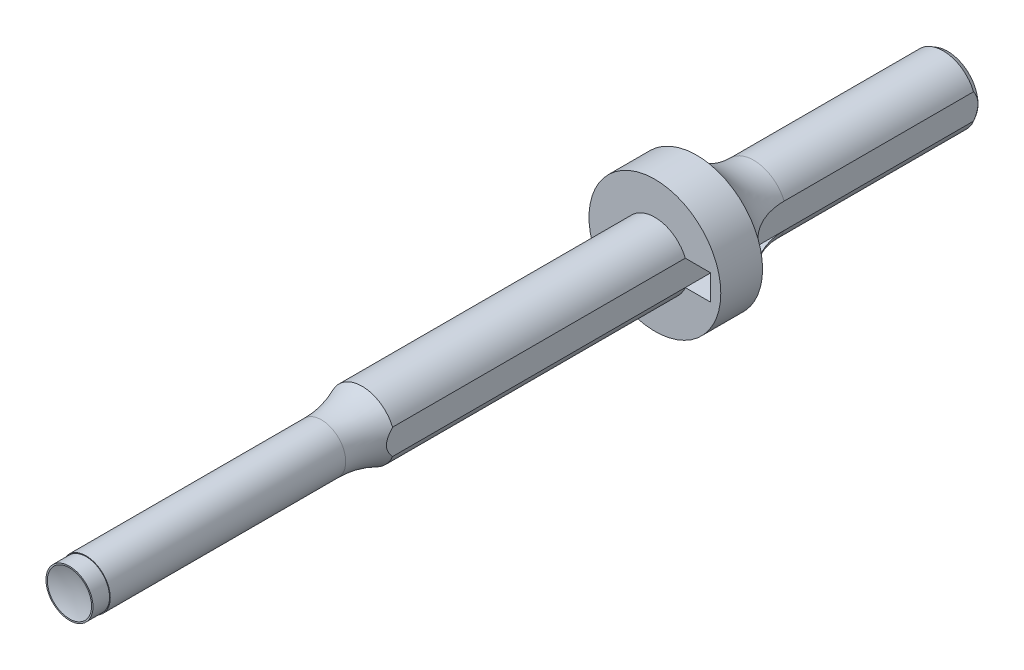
ISO-10303-21;
HEADER;
FILE_DESCRIPTION(('STEP AP214'),'2;1');
FILE_NAME('part.step','',(''),(''),'','','');
FILE_SCHEMA(('AUTOMOTIVE_DESIGN { 1 0 10303 214 1 1 1 1 }'));
ENDSEC;
DATA;
#1=APPLICATION_CONTEXT('core data for automotive mechanical design processes');
#2=APPLICATION_PROTOCOL_DEFINITION('international standard','automotive_design',2000,#1);
#3=PRODUCT_CONTEXT('',#1,'mechanical');
#4=PRODUCT('Part','Part','',(#3));
#5=PRODUCT_RELATED_PRODUCT_CATEGORY('part','',(#4));
#6=PRODUCT_DEFINITION_FORMATION('','',#4);
#7=PRODUCT_DEFINITION_CONTEXT('part definition',#1,'design');
#8=PRODUCT_DEFINITION('design','',#6,#7);
#9=PRODUCT_DEFINITION_SHAPE('','',#8);
#10=(LENGTH_UNIT() NAMED_UNIT(*) SI_UNIT(.MILLI.,.METRE.));
#11=(NAMED_UNIT(*) PLANE_ANGLE_UNIT() SI_UNIT($,.RADIAN.));
#12=(NAMED_UNIT(*) SI_UNIT($,.STERADIAN.) SOLID_ANGLE_UNIT());
#13=UNCERTAINTY_MEASURE_WITH_UNIT(LENGTH_MEASURE(1.E-05),#10,'distance_accuracy_value','');
#14=(GEOMETRIC_REPRESENTATION_CONTEXT(3) GLOBAL_UNCERTAINTY_ASSIGNED_CONTEXT((#13)) GLOBAL_UNIT_ASSIGNED_CONTEXT((#10,
#11,#12)) REPRESENTATION_CONTEXT('',''));
#15=CARTESIAN_POINT('',(0.,0.,0.));
#16=DIRECTION('',(0.,0.,1.));
#17=DIRECTION('',(1.,0.,0.));
#18=AXIS2_PLACEMENT_3D('',#15,#16,#17);
#19=CARTESIAN_POINT('',(0.,0.,-127.));
#20=DIRECTION('',(0.,0.,1.));
#21=DIRECTION('',(1.,0.,0.));
#22=AXIS2_PLACEMENT_3D('',#19,#20,#21);
#23=CYLINDRICAL_SURFACE('',#22,4.765);
#24=DIRECTION('',(0.,0.,-1.));
#25=VECTOR('',#24,1.);
#26=CARTESIAN_POINT('',(4.39549582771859,1.83979385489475,0.));
#27=LINE('',#26,#25);
#28=CARTESIAN_POINT('',(4.39549582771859,1.83979385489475,-42.333));
#29=VERTEX_POINT('',#28);
#30=CARTESIAN_POINT('',(4.39549582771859,1.83979385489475,-84.667));
#31=VERTEX_POINT('',#30);
#32=EDGE_CURVE('E198',#29,#31,#27,.T.);
#33=ORIENTED_EDGE('',*,*,#32,.T.);
#34=CARTESIAN_POINT('',(0.,0.,-84.667));
#35=DIRECTION('',(0.,0.,-1.));
#36=DIRECTION('',(-1.,0.,0.));
#37=AXIS2_PLACEMENT_3D('',#34,#35,#36);
#38=CIRCLE('',#37,4.765);
#39=CARTESIAN_POINT('',(4.39549582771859,-1.83979385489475,-84.667));
#40=VERTEX_POINT('',#39);
#41=EDGE_CURVE('E147',#31,#40,#38,.F.);
#42=ORIENTED_EDGE('',*,*,#41,.T.);
#43=DIRECTION('',(0.,0.,-1.));
#44=VECTOR('',#43,1.);
#45=CARTESIAN_POINT('',(4.39549582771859,-1.83979385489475,0.));
#46=LINE('',#45,#44);
#47=CARTESIAN_POINT('',(4.39549582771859,-1.83979385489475,-42.3330000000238));
#48=VERTEX_POINT('',#47);
#49=EDGE_CURVE('E63',#48,#40,#46,.T.);
#50=ORIENTED_EDGE('',*,*,#49,.F.);
#51=CARTESIAN_POINT('',(0.,0.,-42.333));
#52=DIRECTION('',(0.,0.,-1.));
#53=DIRECTION('',(0.,1.,0.));
#54=AXIS2_PLACEMENT_3D('',#51,#52,#53);
#55=CIRCLE('',#54,4.765);
#56=EDGE_CURVE('E148',#48,#29,#55,.T.);
#57=ORIENTED_EDGE('',*,*,#56,.T.);
#58=EDGE_LOOP('',(#33,#42,#50,#57));
#59=FACE_BOUND('',#58,.T.);
#60=ADVANCED_FACE('F40',(#59),#23,.T.);
#61=CARTESIAN_POINT('',(0.,0.,-42.333));
#62=DIRECTION('',(0.,0.,1.));
#63=DIRECTION('',(1.,0.,0.));
#64=AXIS2_PLACEMENT_3D('',#61,#62,#63);
#65=CYLINDRICAL_SURFACE('',#64,3.5);
#66=CARTESIAN_POINT('',(0.,0.,-36.4537036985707));
#67=DIRECTION('',(0.,0.,1.));
#68=DIRECTION('',(0.,-1.,0.));
#69=AXIS2_PLACEMENT_3D('',#66,#67,#68);
#70=CIRCLE('',#69,3.5);
#71=CARTESIAN_POINT('',(0.,-3.5,-36.4537036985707));
#72=VERTEX_POINT('',#71);
#73=EDGE_CURVE('E176',#72,#72,#70,.F.);
#74=ORIENTED_EDGE('',*,*,#73,.F.);
#75=EDGE_LOOP('',(#74));
#76=FACE_BOUND('',#75,.T.);
#77=CARTESIAN_POINT('',(0.,0.,-2.4));
#78=DIRECTION('',(0.,0.,1.));
#79=DIRECTION('',(1.,0.,0.));
#80=AXIS2_PLACEMENT_3D('',#77,#78,#79);
#81=CIRCLE('',#80,3.5);
#82=CARTESIAN_POINT('',(3.5,0.,-2.4));
#83=VERTEX_POINT('',#82);
#84=EDGE_CURVE('E161',#83,#83,#81,.F.);
#85=ORIENTED_EDGE('',*,*,#84,.T.);
#86=EDGE_LOOP('',(#85));
#87=FACE_BOUND('',#86,.T.);
#88=ADVANCED_FACE('F276',(#76,#87),#65,.T.);
#89=CARTESIAN_POINT('',(0.,0.,-2.4));
#90=DIRECTION('',(0.,0.,1.));
#91=DIRECTION('',(1.,0.,0.));
#92=AXIS2_PLACEMENT_3D('',#89,#90,#91);
#93=PLANE('',#92);
#94=ORIENTED_EDGE('',*,*,#84,.F.);
#95=EDGE_LOOP('',(#94));
#96=FACE_BOUND('',#95,.T.);
#97=CARTESIAN_POINT('',(0.,0.,-2.4));
#98=DIRECTION('',(0.,0.,1.));
#99=DIRECTION('',(1.,0.,0.));
#100=AXIS2_PLACEMENT_3D('',#97,#98,#99);
#101=CIRCLE('',#100,3.4);
#102=CARTESIAN_POINT('',(3.4,0.,-2.4));
#103=VERTEX_POINT('',#102);
#104=EDGE_CURVE('E157',#103,#103,#101,.T.);
#105=ORIENTED_EDGE('',*,*,#104,.F.);
#106=EDGE_LOOP('',(#105));
#107=FACE_BOUND('',#106,.T.);
#108=ADVANCED_FACE('F272',(#96,#107),#93,.T.);
#109=CARTESIAN_POINT('',(0.,0.,-2.4));
#110=DIRECTION('',(0.,0.,1.));
#111=DIRECTION('',(1.,0.,0.));
#112=AXIS2_PLACEMENT_3D('',#109,#110,#111);
#113=CYLINDRICAL_SURFACE('',#112,3.4);
#114=ORIENTED_EDGE('',*,*,#104,.T.);
#115=EDGE_LOOP('',(#114));
#116=FACE_BOUND('',#115,.T.);
#117=CARTESIAN_POINT('',(0.,0.,0.));
#118=DIRECTION('',(0.,0.,1.));
#119=DIRECTION('',(1.,0.,0.));
#120=AXIS2_PLACEMENT_3D('',#117,#118,#119);
#121=CIRCLE('',#120,3.4);
#122=CARTESIAN_POINT('',(3.4,0.,0.));
#123=VERTEX_POINT('',#122);
#124=EDGE_CURVE('E156',#123,#123,#121,.T.);
#125=ORIENTED_EDGE('',*,*,#124,.F.);
#126=EDGE_LOOP('',(#125));
#127=FACE_BOUND('',#126,.T.);
#128=ADVANCED_FACE('F269',(#116,#127),#113,.T.);
#129=CARTESIAN_POINT('',(0.,0.,0.));
#130=DIRECTION('',(0.,0.,1.));
#131=DIRECTION('',(1.,0.,0.));
#132=AXIS2_PLACEMENT_3D('',#129,#130,#131);
#133=PLANE('',#132);
#134=CARTESIAN_POINT('',(0.,0.,0.));
#135=DIRECTION('',(0.,0.,1.));
#136=DIRECTION('',(0.,-1.,0.));
#137=AXIS2_PLACEMENT_3D('',#134,#135,#136);
#138=CIRCLE('',#137,3.2);
#139=CARTESIAN_POINT('',(0.,-3.2,0.));
#140=VERTEX_POINT('',#139);
#141=EDGE_CURVE('E152',#140,#140,#138,.T.);
#142=ORIENTED_EDGE('',*,*,#141,.F.);
#143=EDGE_LOOP('',(#142));
#144=FACE_BOUND('',#143,.T.);
#145=ORIENTED_EDGE('',*,*,#124,.T.);
#146=EDGE_LOOP('',(#145));
#147=FACE_BOUND('',#146,.T.);
#148=ADVANCED_FACE('F267',(#144,#147),#133,.T.);
#149=CARTESIAN_POINT('',(0.,0.,8.97668647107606));
#150=DIRECTION('',(0.,0.,1.));
#151=DIRECTION('',(0.,1.,0.));
#152=AXIS2_PLACEMENT_3D('',#149,#150,#151);
#153=SPHERICAL_SURFACE('',#152,9.53);
#154=ORIENTED_EDGE('',*,*,#141,.T.);
#155=EDGE_LOOP('',(#154));
#156=FACE_BOUND('',#155,.T.);
#157=ADVANCED_FACE('F263',(#156),#153,.F.);
#158=CARTESIAN_POINT('',(0.,0.,-36.4537036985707));
#159=DIRECTION('',(0.,0.,-1.));
#160=DIRECTION('',(0.,1.,0.));
#161=AXIS2_PLACEMENT_3D('',#158,#159,#160);
#162=TOROIDAL_SURFACE('',#161,17.795,14.295);
#163=CARTESIAN_POINT('',(4.39549582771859,8.77580604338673,-48.3140317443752));
#164=CARTESIAN_POINT('',(4.39549582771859,8.57569992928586,-48.1936621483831));
#165=CARTESIAN_POINT('',(4.39549582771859,8.37784880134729,-48.0695715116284));
#166=CARTESIAN_POINT('',(4.39549582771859,7.98672980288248,-47.8144323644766));
#167=CARTESIAN_POINT('',(4.39549582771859,7.79346116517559,-47.6833850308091));
#168=CARTESIAN_POINT('',(4.39549582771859,7.41185102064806,-47.4150135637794));
#169=CARTESIAN_POINT('',(4.39549582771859,7.22350139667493,-47.277700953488));
#170=CARTESIAN_POINT('',(4.39549582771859,6.85132024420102,-46.9970757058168));
#171=CARTESIAN_POINT('',(4.39549582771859,6.66748889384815,-46.8537628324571));
#172=CARTESIAN_POINT('',(4.39549582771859,6.30611541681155,-46.5631911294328));
#173=CARTESIAN_POINT('',(4.39549582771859,6.12852777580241,-46.415988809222));
#174=CARTESIAN_POINT('',(4.39549582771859,5.77744023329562,-46.116785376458));
#175=CARTESIAN_POINT('',(4.39549582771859,5.60394045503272,-45.9647841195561));
#176=CARTESIAN_POINT('',(4.39549582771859,5.26064882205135,-45.6565520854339));
#177=CARTESIAN_POINT('',(4.39549582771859,5.09085815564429,-45.5003199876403));
#178=CARTESIAN_POINT('',(4.39549582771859,4.75456331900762,-45.1843666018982));
#179=CARTESIAN_POINT('',(4.39549582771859,4.58805915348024,-45.0246453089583));
#180=CARTESIAN_POINT('',(4.39549582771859,4.2595478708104,-44.7043667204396));
#181=CARTESIAN_POINT('',(4.39549582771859,4.09751112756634,-44.5438397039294));
#182=CARTESIAN_POINT('',(4.39549582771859,3.77509953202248,-44.2211645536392));
#183=CARTESIAN_POINT('',(4.39549582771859,3.61472451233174,-44.0590165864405));
#184=CARTESIAN_POINT('',(4.39549582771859,3.29415714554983,-43.7342079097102));
#185=CARTESIAN_POINT('',(4.39549582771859,3.13396516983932,-43.5715468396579));
#186=CARTESIAN_POINT('',(4.39549582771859,2.81206790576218,-43.2477295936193));
#187=CARTESIAN_POINT('',(4.39549582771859,2.6503627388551,-43.0865732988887));
#188=CARTESIAN_POINT('',(4.39549582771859,2.40188400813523,-42.8457541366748));
#189=CARTESIAN_POINT('',(4.39549582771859,2.31674209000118,-42.7644168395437));
#190=CARTESIAN_POINT('',(4.39549582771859,2.14470021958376,-42.6036291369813));
#191=CARTESIAN_POINT('',(4.39549582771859,2.05780042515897,-42.5241785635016));
#192=CARTESIAN_POINT('',(4.39549582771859,1.88149605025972,-42.3680300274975));
#193=CARTESIAN_POINT('',(4.39549582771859,1.79209074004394,-42.2913328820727));
#194=CARTESIAN_POINT('',(4.39549582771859,1.60990647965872,-42.142082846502));
#195=CARTESIAN_POINT('',(4.39549582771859,1.51712869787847,-42.0695285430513));
#196=CARTESIAN_POINT('',(4.39549582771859,1.30605820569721,-41.9151566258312));
#197=CARTESIAN_POINT('',(4.39549582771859,1.18665362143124,-41.8348289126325));
#198=CARTESIAN_POINT('',(4.39549582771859,0.938862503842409,-41.6892579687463));
#199=CARTESIAN_POINT('',(4.39549582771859,0.810495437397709,-41.6239832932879));
#200=CARTESIAN_POINT('',(4.39549582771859,0.583257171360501,-41.5337799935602));
#201=CARTESIAN_POINT('',(4.39549582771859,0.486928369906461,-41.5026271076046));
#202=CARTESIAN_POINT('',(4.39549582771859,0.290482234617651,-41.4565899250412));
#203=CARTESIAN_POINT('',(4.39549582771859,0.190372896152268,-41.4416730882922));
#204=CARTESIAN_POINT('',(4.39549582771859,-0.01156243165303,-41.4306079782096));
#205=CARTESIAN_POINT('',(4.39549582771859,-0.113395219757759,-41.4345767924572));
#206=CARTESIAN_POINT('',(4.39549582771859,-0.314609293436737,-41.4607860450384));
#207=CARTESIAN_POINT('',(4.39549582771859,-0.413988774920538,-41.4830395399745));
#208=CARTESIAN_POINT('',(4.39549582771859,-0.647645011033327,-41.5543208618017));
#209=CARTESIAN_POINT('',(4.39549582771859,-0.779663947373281,-41.6105593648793));
#210=CARTESIAN_POINT('',(4.39549582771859,-0.97044483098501,-41.7087535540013));
#211=CARTESIAN_POINT('',(4.39549582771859,-1.03300896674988,-41.7439187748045));
#212=CARTESIAN_POINT('',(4.39549582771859,-1.15594016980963,-41.8178893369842));
#213=CARTESIAN_POINT('',(4.39549582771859,-1.21630806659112,-41.8566932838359));
#214=CARTESIAN_POINT('',(4.39549582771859,-1.39388060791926,-41.9768603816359));
#215=CARTESIAN_POINT('',(4.39549582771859,-1.50825762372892,-42.0623639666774));
#216=CARTESIAN_POINT('',(4.39549582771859,-1.73165888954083,-42.2401506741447));
#217=CARTESIAN_POINT('',(4.39549582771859,-1.84067772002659,-42.3324404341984));
#218=CARTESIAN_POINT('',(4.39549582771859,-2.05528531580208,-42.5214916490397));
#219=CARTESIAN_POINT('',(4.39549582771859,-2.16086349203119,-42.6182650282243));
#220=CARTESIAN_POINT('',(4.39549582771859,-2.36955953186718,-42.8144344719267));
#221=CARTESIAN_POINT('',(4.39549582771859,-2.47267704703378,-42.9138309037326));
#222=CARTESIAN_POINT('',(4.39549582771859,-2.67811046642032,-43.1148716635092));
#223=CARTESIAN_POINT('',(4.39549582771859,-2.78041567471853,-43.2165268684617));
#224=CARTESIAN_POINT('',(4.39549582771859,-2.98421749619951,-43.4206581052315));
#225=CARTESIAN_POINT('',(4.39549582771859,-3.08571404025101,-43.5231342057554));
#226=CARTESIAN_POINT('',(4.39549582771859,-3.38950767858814,-43.8305743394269));
#227=CARTESIAN_POINT('',(4.39549582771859,-3.59144795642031,-44.0358902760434));
#228=CARTESIAN_POINT('',(4.39549582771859,-3.98351711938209,-44.4303774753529));
#229=CARTESIAN_POINT('',(4.39549582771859,-4.17350421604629,-44.619688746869));
#230=CARTESIAN_POINT('',(4.39549582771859,-4.55688891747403,-44.9948391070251));
#231=CARTESIAN_POINT('',(4.39549582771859,-4.7502864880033,-45.1806782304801));
#232=CARTESIAN_POINT('',(4.39549582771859,-5.14157018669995,-45.5475929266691));
#233=CARTESIAN_POINT('',(4.39549582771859,-5.33945638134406,-45.7286684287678));
#234=CARTESIAN_POINT('',(4.39549582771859,-5.74041934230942,-46.0849741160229));
#235=CARTESIAN_POINT('',(4.39549582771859,-5.9434958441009,-46.2602045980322));
#236=CARTESIAN_POINT('',(4.39549582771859,-6.3560542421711,-46.6045116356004));
#237=CARTESIAN_POINT('',(4.39549582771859,-6.56555654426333,-46.7735637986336));
#238=CARTESIAN_POINT('',(4.39549582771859,-6.99052349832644,-47.1039852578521));
#239=CARTESIAN_POINT('',(4.39549582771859,-7.20598776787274,-47.2653550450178));
#240=CARTESIAN_POINT('',(4.39549582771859,-7.64358598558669,-47.5800501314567));
#241=CARTESIAN_POINT('',(4.39549582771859,-7.86573596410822,-47.7333531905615));
#242=CARTESIAN_POINT('',(4.39549582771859,-8.31618358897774,-48.030775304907));
#243=CARTESIAN_POINT('',(4.39549582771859,-8.54448289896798,-48.1748918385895));
#244=CARTESIAN_POINT('',(4.39549582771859,-8.77580604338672,-48.3140317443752));
#245=B_SPLINE_CURVE_WITH_KNOTS('',3,(#163,#164,#165,#166,#167,#168,#169,#170,#171,#172,#173,
#174,#175,#176,#177,#178,#179,#180,#181,#182,#183,#184,#185,#186,#187,#188,#189,#190,#191,#192,
#193,#194,#195,#196,#197,#198,#199,#200,#201,#202,#203,#204,#205,#206,#207,#208,#209,#210,#211,
#212,#213,#214,#215,#216,#217,#218,#219,#220,#221,#222,#223,#224,#225,#226,#227,#228,#229,#230,
#231,#232,#233,#234,#235,#236,#237,#238,#239,#240,#241,#242,#243,#244),.UNSPECIFIED.,.F.,.F.,(4,
2,2,2,2,2,2,2,2,2,2,2,2,2,2,2,2,2,2,2,2,2,2,2,2,2,2,2,2,2,2,2,2,2,2,2,2,2,2,2,4),(0.,
0.700496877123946,1.40087563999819,2.10001446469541,2.79918081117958,3.49107877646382,
4.18299757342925,4.8751348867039,5.56727319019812,6.2515224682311,6.93570213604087,
7.6206038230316,8.30545099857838,8.65867999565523,9.01187741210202,9.36517879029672,
9.7183589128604,10.149490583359,10.5797133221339,10.8823484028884,11.1843758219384,
11.4882781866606,11.7923977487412,12.2202866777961,12.4355393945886,12.6507099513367,
13.0786568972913,13.5070281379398,13.9366126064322,14.3662575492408,14.7989161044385,
15.2316112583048,16.0955606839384,16.9001494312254,17.7047301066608,18.5093227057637,
19.3138743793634,20.1213189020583,20.9287117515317,21.7382250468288,22.5479595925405),.UNSPECIFIED.);
#246=EDGE_CURVE('E203',#29,#48,#245,.T.);
#247=ORIENTED_EDGE('',*,*,#246,.F.);
#248=ORIENTED_EDGE('',*,*,#56,.F.);
#249=EDGE_LOOP('',(#247,#248));
#250=FACE_BOUND('',#249,.T.);
#251=ORIENTED_EDGE('',*,*,#73,.T.);
#252=EDGE_LOOP('',(#251));
#253=FACE_BOUND('',#252,.T.);
#254=ADVANCED_FACE('F259',(#250,#253),#162,.F.);
#255=CARTESIAN_POINT('',(0.,0.,-84.667));
#256=DIRECTION('',(0.,0.,-1.));
#257=DIRECTION('',(-1.,0.,0.));
#258=AXIS2_PLACEMENT_3D('',#255,#256,#257);
#259=PLANE('',#258);
#260=ORIENTED_EDGE('',*,*,#41,.F.);
#261=DIRECTION('',(1.,0.,0.));
#262=VECTOR('',#261,1.);
#263=CARTESIAN_POINT('',(0.,1.83979385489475,-84.667));
#264=LINE('',#263,#262);
#265=CARTESIAN_POINT('',(8.07508353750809,1.83979385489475,-84.667));
#266=VERTEX_POINT('',#265);
#267=EDGE_CURVE('E125',#31,#266,#264,.T.);
#268=ORIENTED_EDGE('',*,*,#267,.T.);
#269=DIRECTION('',(0.,-1.,0.));
#270=VECTOR('',#269,1.);
#271=CARTESIAN_POINT('',(8.07508353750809,0.,-84.667));
#272=LINE('',#271,#270);
#273=CARTESIAN_POINT('',(8.07508353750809,-1.83979385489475,-84.667));
#274=VERTEX_POINT('',#273);
#275=EDGE_CURVE('E118',#266,#274,#272,.T.);
#276=ORIENTED_EDGE('',*,*,#275,.T.);
#277=DIRECTION('',(-1.,0.,0.));
#278=VECTOR('',#277,1.);
#279=CARTESIAN_POINT('',(0.,-1.83979385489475,-84.667));
#280=LINE('',#279,#278);
#281=EDGE_CURVE('E102',#274,#40,#280,.T.);
#282=ORIENTED_EDGE('',*,*,#281,.T.);
#283=EDGE_LOOP('',(#260,#268,#276,#282));
#284=FACE_BOUND('',#283,.T.);
#285=CARTESIAN_POINT('',(0.,0.,-84.667));
#286=DIRECTION('',(0.,0.,1.));
#287=DIRECTION('',(1.,0.,0.));
#288=AXIS2_PLACEMENT_3D('',#285,#286,#287);
#289=CIRCLE('',#288,9.52999999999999);
#290=CARTESIAN_POINT('',(9.52999999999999,0.,-84.667));
#291=VERTEX_POINT('',#290);
#292=EDGE_CURVE('E143',#291,#291,#289,.T.);
#293=ORIENTED_EDGE('',*,*,#292,.T.);
#294=EDGE_LOOP('',(#293));
#295=FACE_BOUND('',#294,.T.);
#296=ADVANCED_FACE('F123',(#284,#295),#259,.F.);
#297=CARTESIAN_POINT('',(0.,0.,-84.667));
#298=DIRECTION('',(0.,0.,1.));
#299=DIRECTION('',(1.,0.,0.));
#300=AXIS2_PLACEMENT_3D('',#297,#298,#299);
#301=CYLINDRICAL_SURFACE('',#300,9.52999999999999);
#302=ORIENTED_EDGE('',*,*,#292,.F.);
#303=EDGE_LOOP('',(#302));
#304=FACE_BOUND('',#303,.T.);
#305=CARTESIAN_POINT('',(0.,0.,-90.7087779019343));
#306=DIRECTION('',(0.,0.,1.));
#307=DIRECTION('',(1.,0.,0.));
#308=AXIS2_PLACEMENT_3D('',#305,#306,#307);
#309=CIRCLE('',#308,9.52999999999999);
#310=CARTESIAN_POINT('',(9.52999999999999,0.,-90.7087779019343));
#311=VERTEX_POINT('',#310);
#312=EDGE_CURVE('E133',#311,#311,#309,.T.);
#313=ORIENTED_EDGE('',*,*,#312,.T.);
#314=EDGE_LOOP('',(#313));
#315=FACE_BOUND('',#314,.T.);
#316=ADVANCED_FACE('F247',(#304,#315),#301,.T.);
#317=CARTESIAN_POINT('',(0.,0.,-98.962));
#318=DIRECTION('',(0.,0.,1.));
#319=DIRECTION('',(1.,0.,0.));
#320=AXIS2_PLACEMENT_3D('',#317,#318,#319);
#321=TOROIDAL_SURFACE('',#320,14.295,9.53);
#322=ORIENTED_EDGE('',*,*,#312,.F.);
#323=EDGE_LOOP('',(#322));
#324=FACE_BOUND('',#323,.T.);
#325=CARTESIAN_POINT('',(8.07508353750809,-10.8763117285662,-89.4614586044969));
#326=CARTESIAN_POINT('',(8.07508353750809,-10.7241184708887,-89.4710872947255));
#327=CARTESIAN_POINT('',(8.07508353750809,-10.5720832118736,-89.4830098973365));
#328=CARTESIAN_POINT('',(8.07508353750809,-10.2684340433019,-89.5112118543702));
#329=CARTESIAN_POINT('',(8.07508353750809,-10.1168200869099,-89.5274907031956));
#330=CARTESIAN_POINT('',(8.07508353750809,-9.66301336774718,-89.5824831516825));
#331=CARTESIAN_POINT('',(8.07508353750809,-9.36155569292,-89.6273725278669));
#332=CARTESIAN_POINT('',(8.07508353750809,-8.76359785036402,-89.7311370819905));
#333=CARTESIAN_POINT('',(8.07508353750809,-8.46707731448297,-89.7898973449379));
#334=CARTESIAN_POINT('',(8.07508353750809,-7.87660674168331,-89.9193238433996));
#335=CARTESIAN_POINT('',(8.07508353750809,-7.58265727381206,-89.9899926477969));
#336=CARTESIAN_POINT('',(8.07508353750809,-6.9808482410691,-90.144842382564));
#337=CARTESIAN_POINT('',(8.07508353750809,-6.67312787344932,-90.2295572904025));
#338=CARTESIAN_POINT('',(8.07508353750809,-6.05968238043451,-90.4058365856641));
#339=CARTESIAN_POINT('',(8.07508353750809,-5.75395727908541,-90.4974010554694));
#340=CARTESIAN_POINT('',(8.07508353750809,-5.14260782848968,-90.683397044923));
#341=CARTESIAN_POINT('',(8.07508353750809,-4.83698542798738,-90.7778348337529));
#342=CARTESIAN_POINT('',(8.07508353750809,-4.22498138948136,-90.9642253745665));
#343=CARTESIAN_POINT('',(8.07508353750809,-3.91859980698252,-91.0561783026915));
#344=CARTESIAN_POINT('',(8.07508353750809,-3.41505495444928,-91.1994372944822));
#345=CARTESIAN_POINT('',(8.07508353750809,-3.21865037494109,-91.253373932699));
#346=CARTESIAN_POINT('',(8.07508353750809,-2.82438108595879,-91.3557414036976));
#347=CARTESIAN_POINT('',(8.07508353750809,-2.62651629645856,-91.4041719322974));
#348=CARTESIAN_POINT('',(8.07508353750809,-2.22937596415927,-91.4933971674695));
#349=CARTESIAN_POINT('',(8.07508353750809,-2.03010316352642,-91.5342038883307));
#350=CARTESIAN_POINT('',(8.07508353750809,-1.62984511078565,-91.6061874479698));
#351=CARTESIAN_POINT('',(8.07508353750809,-1.42886030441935,-91.6373667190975));
#352=CARTESIAN_POINT('',(8.07508353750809,-1.03013256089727,-91.6876503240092));
#353=CARTESIAN_POINT('',(8.07508353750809,-0.832423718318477,-91.7070199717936));
#354=CARTESIAN_POINT('',(8.07508353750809,-0.436181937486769,-91.7335618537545));
#355=CARTESIAN_POINT('',(8.07508353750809,-0.237649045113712,-91.7407347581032));
#356=CARTESIAN_POINT('',(8.07508353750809,0.159506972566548,-91.7423906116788));
#357=CARTESIAN_POINT('',(8.07508353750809,0.358130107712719,-91.7368712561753));
#358=CARTESIAN_POINT('',(8.07508353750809,0.754644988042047,-91.7135199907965));
#359=CARTESIAN_POINT('',(8.07508353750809,0.952536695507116,-91.6956874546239));
#360=CARTESIAN_POINT('',(8.07508353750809,1.35476192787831,-91.6479460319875));
#361=CARTESIAN_POINT('',(8.07508353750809,1.55904115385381,-91.6175879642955));
#362=CARTESIAN_POINT('',(8.07508353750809,1.96581065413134,-91.5467221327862));
#363=CARTESIAN_POINT('',(8.07508353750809,2.16830079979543,-91.5062136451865));
#364=CARTESIAN_POINT('',(8.07508353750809,2.57170241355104,-91.4171671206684));
#365=CARTESIAN_POINT('',(8.07508353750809,2.77261199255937,-91.3686206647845));
#366=CARTESIAN_POINT('',(8.07508353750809,3.17290704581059,-91.265691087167));
#367=CARTESIAN_POINT('',(8.07508353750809,3.37229253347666,-91.2113080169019));
#368=CARTESIAN_POINT('',(8.07508353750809,3.77423897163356,-91.0974975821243));
#369=CARTESIAN_POINT('',(8.07508353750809,3.97677605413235,-91.0379869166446));
#370=CARTESIAN_POINT('',(8.07508353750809,4.38121356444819,-90.9168659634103));
#371=CARTESIAN_POINT('',(8.07508353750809,4.5831139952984,-90.8552556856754));
#372=CARTESIAN_POINT('',(8.07508353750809,4.98668031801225,-90.7316272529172));
#373=CARTESIAN_POINT('',(8.07508353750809,5.18834627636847,-90.6696093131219));
#374=CARTESIAN_POINT('',(8.07508353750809,5.59198735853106,-90.5465835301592));
#375=CARTESIAN_POINT('',(8.07508353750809,5.79396248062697,-90.4855756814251));
#376=CARTESIAN_POINT('',(8.07508353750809,6.19682699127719,-90.3663616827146));
#377=CARTESIAN_POINT('',(8.07508353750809,6.39771047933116,-90.3081357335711));
#378=CARTESIAN_POINT('',(8.07508353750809,6.80042282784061,-90.195018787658));
#379=CARTESIAN_POINT('',(8.07508353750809,7.0022516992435,-90.1401278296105));
#380=CARTESIAN_POINT('',(8.07508353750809,7.40696098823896,-90.0346846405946));
#381=CARTESIAN_POINT('',(8.07508353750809,7.60984095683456,-89.9841306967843));
#382=CARTESIAN_POINT('',(8.07508353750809,8.0168253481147,-89.8882269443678));
#383=CARTESIAN_POINT('',(8.07508353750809,8.22092971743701,-89.8428769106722));
#384=CARTESIAN_POINT('',(8.07508353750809,8.62748786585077,-89.7587887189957));
#385=CARTESIAN_POINT('',(8.07508353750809,8.8299240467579,-89.7199659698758));
#386=CARTESIAN_POINT('',(8.07508353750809,9.23593549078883,-89.6488774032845));
#387=CARTESIAN_POINT('',(8.07508353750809,9.43951066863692,-89.6166111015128));
#388=CARTESIAN_POINT('',(8.07508353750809,9.84814033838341,-89.5592271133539));
#389=CARTESIAN_POINT('',(8.07508353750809,10.0531971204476,-89.534125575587));
#390=CARTESIAN_POINT('',(8.07508353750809,10.4641759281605,-89.4917595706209));
#391=CARTESIAN_POINT('',(8.07508353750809,10.6700981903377,-89.4744974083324));
#392=CARTESIAN_POINT('',(8.07508353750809,10.8763117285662,-89.4614586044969));
#393=B_SPLINE_CURVE_WITH_KNOTS('',3,(#325,#326,#327,#328,#329,#330,#331,#332,#333,#334,#335,
#336,#337,#338,#339,#340,#341,#342,#343,#344,#345,#346,#347,#348,#349,#350,#351,#352,#353,#354,
#355,#356,#357,#358,#359,#360,#361,#362,#363,#364,#365,#366,#367,#368,#369,#370,#371,#372,#373,
#374,#375,#376,#377,#378,#379,#380,#381,#382,#383,#384,#385,#386,#387,#388,#389,#390,#391,#392),
.UNSPECIFIED.,.F.,.F.,(4,2,2,2,2,2,2,2,2,2,2,2,2,2,2,2,2,2,2,2,2,2,2,2,2,2,2,2,2,2,2,2,2,4),(0.,
0.45745339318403,0.914853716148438,1.82875348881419,2.73533238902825,3.64210710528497,
4.59948598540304,5.55687638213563,6.51653130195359,7.47611801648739,8.08709236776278,
8.69810045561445,9.30813738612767,9.91802006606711,10.513641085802,11.1092293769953,
11.7049258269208,12.3006525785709,12.9199099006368,13.5392113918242,14.1591656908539,
14.7791145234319,15.412389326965,16.0456611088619,16.6786218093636,17.3115790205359,
17.9390141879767,18.5664566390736,19.193650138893,19.8208164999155,20.4390951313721,
21.0573280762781,21.6769436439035,22.2967412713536),.UNSPECIFIED.);
#394=CARTESIAN_POINT('',(8.07508353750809,-1.83979385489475,-91.5684255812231));
#395=VERTEX_POINT('',#394);
#396=CARTESIAN_POINT('',(8.07508353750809,1.83979385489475,-91.5684255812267));
#397=VERTEX_POINT('',#396);
#398=EDGE_CURVE('E12',#395,#397,#393,.T.);
#399=ORIENTED_EDGE('',*,*,#398,.T.);
#400=CARTESIAN_POINT('',(17.1116014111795,1.83979385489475,-89.8888318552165));
#401=CARTESIAN_POINT('',(16.852425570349,1.83979385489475,-89.8060034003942));
#402=CARTESIAN_POINT('',(16.589722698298,1.83979385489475,-89.7342446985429));
#403=CARTESIAN_POINT('',(16.0592133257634,1.83979385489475,-89.6132108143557));
#404=CARTESIAN_POINT('',(15.791407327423,1.83979385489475,-89.563933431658));
#405=CARTESIAN_POINT('',(15.2529108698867,1.83979385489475,-89.4882348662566));
#406=CARTESIAN_POINT('',(14.9822242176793,1.83979385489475,-89.4617865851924));
#407=CARTESIAN_POINT('',(14.4395871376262,1.83979385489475,-89.4317678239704));
#408=CARTESIAN_POINT('',(14.1676367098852,1.83979385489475,-89.4281973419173));
#409=CARTESIAN_POINT('',(13.6243436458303,1.83979385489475,-89.4438991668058));
#410=CARTESIAN_POINT('',(13.3530011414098,1.83979385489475,-89.4631760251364));
#411=CARTESIAN_POINT('',(12.8128771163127,1.83979385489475,-89.5243735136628));
#412=CARTESIAN_POINT('',(12.5440956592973,1.83979385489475,-89.5662947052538));
#413=CARTESIAN_POINT('',(12.0109884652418,1.83979385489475,-89.6724078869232));
#414=CARTESIAN_POINT('',(11.7466623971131,1.83979385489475,-89.7365982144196));
#415=CARTESIAN_POINT('',(11.2242613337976,1.83979385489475,-89.8867240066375));
#416=CARTESIAN_POINT('',(10.9661863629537,1.83979385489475,-89.9726595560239));
#417=CARTESIAN_POINT('',(10.4556735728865,1.83979385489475,-90.1665003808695));
#418=CARTESIAN_POINT('',(10.2033105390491,1.83979385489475,-90.2746026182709));
#419=CARTESIAN_POINT('',(9.70837615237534,1.83979385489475,-90.5114779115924));
#420=CARTESIAN_POINT('',(9.46580820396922,1.83979385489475,-90.6402580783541));
#421=CARTESIAN_POINT('',(8.99219389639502,1.83979385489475,-90.9174974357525));
#422=CARTESIAN_POINT('',(8.76114753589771,1.83979385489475,-91.0659566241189));
#423=CARTESIAN_POINT('',(8.31211850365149,1.83979385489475,-91.3814784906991));
#424=CARTESIAN_POINT('',(8.09413629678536,1.83979385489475,-91.5485418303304));
#425=CARTESIAN_POINT('',(7.66962161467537,1.83979385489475,-91.9026623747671));
#426=CARTESIAN_POINT('',(7.46330313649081,1.83979385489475,-92.0899761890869));
#427=CARTESIAN_POINT('',(7.06707172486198,1.83979385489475,-92.4812210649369));
#428=CARTESIAN_POINT('',(6.87715892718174,1.83979385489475,-92.685152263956));
#429=CARTESIAN_POINT('',(6.51505899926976,1.83979385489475,-93.1083095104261));
#430=CARTESIAN_POINT('',(6.34287781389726,1.83979385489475,-93.3275406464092));
#431=CARTESIAN_POINT('',(6.01766421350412,1.83979385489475,-93.7797645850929));
#432=CARTESIAN_POINT('',(5.86463091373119,1.83979385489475,-94.012756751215));
#433=CARTESIAN_POINT('',(5.57862889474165,1.83979385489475,-94.4916587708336));
#434=CARTESIAN_POINT('',(5.44571849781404,1.83979385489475,-94.7376034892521));
#435=CARTESIAN_POINT('',(5.20189203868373,1.83979385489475,-95.2400445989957));
#436=CARTESIAN_POINT('',(5.0909662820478,1.83979385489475,-95.4965362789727));
#437=CARTESIAN_POINT('',(4.89242704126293,1.83979385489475,-96.0182850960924));
#438=CARTESIAN_POINT('',(4.8048040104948,1.83979385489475,-96.2835385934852));
#439=CARTESIAN_POINT('',(4.65410458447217,1.83979385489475,-96.8209317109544));
#440=CARTESIAN_POINT('',(4.59102632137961,1.83979385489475,-97.0930708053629));
#441=CARTESIAN_POINT('',(4.49314299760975,1.83979385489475,-97.6276610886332));
#442=CARTESIAN_POINT('',(4.45702988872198,1.83979385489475,-97.8898729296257));
#443=CARTESIAN_POINT('',(4.4084661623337,1.83979385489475,-98.416479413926));
#444=CARTESIAN_POINT('',(4.39601450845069,1.83979385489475,-98.6808739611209));
#445=CARTESIAN_POINT('',(4.39500903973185,1.83979385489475,-99.2096375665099));
#446=CARTESIAN_POINT('',(4.40644901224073,1.83979385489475,-99.4740066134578));
#447=CARTESIAN_POINT('',(4.45299699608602,1.83979385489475,-100.000645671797));
#448=CARTESIAN_POINT('',(4.48810461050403,1.83979385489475,-100.262915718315));
#449=CARTESIAN_POINT('',(4.57854077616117,1.83979385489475,-100.767600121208));
#450=CARTESIAN_POINT('',(4.63252159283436,1.83979385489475,-101.0102577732));
#451=CARTESIAN_POINT('',(4.76008669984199,1.83979385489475,-101.490447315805));
#452=CARTESIAN_POINT('',(4.83367781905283,1.83979385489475,-101.727977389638));
#453=CARTESIAN_POINT('',(4.99955877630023,1.83979385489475,-102.196383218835));
#454=CARTESIAN_POINT('',(5.09184719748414,1.83979385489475,-102.427259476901));
#455=CARTESIAN_POINT('',(5.29421681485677,1.83979385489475,-102.881165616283));
#456=CARTESIAN_POINT('',(5.4043045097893,1.83979385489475,-103.104192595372));
#457=CARTESIAN_POINT('',(5.64748974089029,1.83979385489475,-103.55253698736));
#458=CARTESIAN_POINT('',(5.78148875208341,1.83979385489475,-103.777365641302));
#459=CARTESIAN_POINT('',(6.06700456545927,1.83979385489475,-104.215613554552));
#460=CARTESIAN_POINT('',(6.21852220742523,1.83979385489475,-104.429032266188));
#461=CARTESIAN_POINT('',(6.53806130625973,1.83979385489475,-104.843329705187));
#462=CARTESIAN_POINT('',(6.7060922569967,1.83979385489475,-105.044201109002));
#463=CARTESIAN_POINT('',(7.0574056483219,1.83979385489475,-105.432016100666));
#464=CARTESIAN_POINT('',(7.2406835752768,1.83979385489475,-105.618963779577));
#465=CARTESIAN_POINT('',(7.63316025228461,1.83979385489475,-105.988968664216));
#466=CARTESIAN_POINT('',(7.84326106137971,1.83979385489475,-106.171070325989));
#467=CARTESIAN_POINT('',(8.27787597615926,1.83979385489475,-106.517015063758));
#468=CARTESIAN_POINT('',(8.50238524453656,1.83979385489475,-106.680864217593));
#469=CARTESIAN_POINT('',(8.96407572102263,1.83979385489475,-106.989007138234));
#470=CARTESIAN_POINT('',(9.20124245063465,1.83979385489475,-107.133322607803));
#471=CARTESIAN_POINT('',(9.68675812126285,1.83979385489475,-107.401474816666));
#472=CARTESIAN_POINT('',(9.93510122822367,1.83979385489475,-107.525322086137));
#473=CARTESIAN_POINT('',(10.3399141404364,1.83979385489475,-107.706318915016));
#474=CARTESIAN_POINT('',(10.4933577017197,1.83979385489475,-107.770319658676));
#475=CARTESIAN_POINT('',(10.8030468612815,1.83979385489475,-107.89037573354));
#476=CARTESIAN_POINT('',(10.9592877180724,1.83979385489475,-107.946443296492));
#477=CARTESIAN_POINT('',(11.1168694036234,1.83979385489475,-107.998517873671));
#478=B_SPLINE_CURVE_WITH_KNOTS('',3,(#400,#401,#402,#403,#404,#405,#406,#407,#408,#409,#410,
#411,#412,#413,#414,#415,#416,#417,#418,#419,#420,#421,#422,#423,#424,#425,#426,#427,#428,#429,
#430,#431,#432,#433,#434,#435,#436,#437,#438,#439,#440,#441,#442,#443,#444,#445,#446,#447,#448,
#449,#450,#451,#452,#453,#454,#455,#456,#457,#458,#459,#460,#461,#462,#463,#464,#465,#466,#467,
#468,#469,#470,#471,#472,#473,#474,#475,#476,#477),.UNSPECIFIED.,.F.,.F.,(4,2,2,2,2,2,2,2,2,2,2,
2,2,2,2,2,2,2,2,2,2,2,2,2,2,2,2,2,2,2,2,2,2,2,2,2,2,2,4),(0.,0.816008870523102,1.63193785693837,
2.44689699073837,3.26185605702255,4.07697749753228,4.89211914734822,5.70719995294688,
6.52228393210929,7.3449512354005,8.16790205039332,8.99085277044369,9.8138327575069,
10.6488451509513,11.4838644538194,12.3191628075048,13.1544225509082,13.9920586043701,
14.8293244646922,15.66624678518,16.5031054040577,17.2961230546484,18.0891059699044,
18.8818827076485,19.674646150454,20.4195813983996,21.1647763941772,21.9099149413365,
22.6553261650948,23.4396693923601,24.2240502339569,25.0088847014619,25.7934876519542,
26.626611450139,27.459456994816,28.2913694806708,29.1228526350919,29.621426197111,
30.1192224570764),.UNSPECIFIED.);
#479=CARTESIAN_POINT('',(4.39549582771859,1.83979385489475,-98.962));
#480=VERTEX_POINT('',#479);
#481=EDGE_CURVE('E136',#397,#480,#478,.T.);
#482=ORIENTED_EDGE('',*,*,#481,.T.);
#483=CARTESIAN_POINT('',(0.,0.,-98.962));
#484=DIRECTION('',(0.,0.,1.));
#485=DIRECTION('',(1.,0.,0.));
#486=AXIS2_PLACEMENT_3D('',#483,#484,#485);
#487=CIRCLE('',#486,4.765);
#488=CARTESIAN_POINT('',(4.39549582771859,-1.83979385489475,-98.962));
#489=VERTEX_POINT('',#488);
#490=EDGE_CURVE('E127',#480,#489,#487,.T.);
#491=ORIENTED_EDGE('',*,*,#490,.T.);
#492=CARTESIAN_POINT('',(11.1168694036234,-1.83979385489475,-107.998517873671));
#493=CARTESIAN_POINT('',(10.8845868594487,-1.83979385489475,-107.921773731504));
#494=CARTESIAN_POINT('',(10.6551926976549,-1.83979385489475,-107.836317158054));
#495=CARTESIAN_POINT('',(10.2034317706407,-1.83979385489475,-107.648597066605));
#496=CARTESIAN_POINT('',(9.98106382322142,-1.83979385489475,-107.546336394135));
#497=CARTESIAN_POINT('',(9.54456163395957,-1.83979385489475,-107.325617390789));
#498=CARTESIAN_POINT('',(9.33042607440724,-1.83979385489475,-107.207161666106));
#499=CARTESIAN_POINT('',(8.91148292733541,-1.83979385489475,-106.9547424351));
#500=CARTESIAN_POINT('',(8.70667630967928,-1.83979385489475,-106.820777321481));
#501=CARTESIAN_POINT('',(8.28051521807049,-1.83979385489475,-106.518996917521));
#502=CARTESIAN_POINT('',(8.06066083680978,-1.83979385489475,-106.349053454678));
#503=CARTESIAN_POINT('',(7.63586969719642,-1.83979385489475,-105.991387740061));
#504=CARTESIAN_POINT('',(7.43093923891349,-1.83979385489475,-105.803658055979));
#505=CARTESIAN_POINT('',(6.84072526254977,-1.83979385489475,-105.215696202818));
#506=CARTESIAN_POINT('',(6.47976113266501,-1.83979385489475,-104.790508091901));
#507=CARTESIAN_POINT('',(5.83193865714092,-1.83979385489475,-103.881964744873));
#508=CARTESIAN_POINT('',(5.54565752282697,-1.83979385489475,-103.398196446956));
#509=CARTESIAN_POINT('',(5.18275965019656,-1.83979385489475,-102.641218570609));
#510=CARTESIAN_POINT('',(5.07284851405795,-1.83979385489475,-102.383555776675));
#511=CARTESIAN_POINT('',(4.87650818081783,-1.83979385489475,-101.859483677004));
#512=CARTESIAN_POINT('',(4.79006739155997,-1.83979385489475,-101.593078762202));
#513=CARTESIAN_POINT('',(4.64462311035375,-1.83979385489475,-101.063274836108));
#514=CARTESIAN_POINT('',(4.58473805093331,-1.83979385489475,-100.800117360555));
#515=CARTESIAN_POINT('',(4.48892389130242,-1.83979385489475,-100.269464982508));
#516=CARTESIAN_POINT('',(4.45299389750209,-1.83979385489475,-100.001970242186));
#517=CARTESIAN_POINT('',(4.40577296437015,-1.83979385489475,-99.4649790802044));
#518=CARTESIAN_POINT('',(4.39446662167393,-1.83979385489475,-99.195484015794));
#519=CARTESIAN_POINT('',(4.39667210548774,-1.83979385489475,-98.6566021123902));
#520=CARTESIAN_POINT('',(4.41018275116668,-1.83979385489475,-98.3872152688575));
#521=CARTESIAN_POINT('',(4.45986785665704,-1.83979385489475,-97.8703724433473));
#522=CARTESIAN_POINT('',(4.49431937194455,-1.83979385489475,-97.6227485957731));
#523=CARTESIAN_POINT('',(4.58376795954,-1.83979385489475,-97.131257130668));
#524=CARTESIAN_POINT('',(4.63876405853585,-1.83979385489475,-96.8873893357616));
#525=CARTESIAN_POINT('',(4.76854067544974,-1.83979385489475,-96.4049303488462));
#526=CARTESIAN_POINT('',(4.84332567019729,-1.83979385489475,-96.1663403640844));
#527=CARTESIAN_POINT('',(5.01179751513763,-1.83979385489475,-95.6958383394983));
#528=CARTESIAN_POINT('',(5.1054917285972,-1.83979385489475,-95.463928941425));
#529=CARTESIAN_POINT('',(5.31357383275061,-1.83979385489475,-95.0020424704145));
#530=CARTESIAN_POINT('',(5.42845177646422,-1.83979385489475,-94.7722862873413));
#531=CARTESIAN_POINT('',(5.67609900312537,-1.83979385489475,-94.3225378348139));
#532=CARTESIAN_POINT('',(5.80887432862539,-1.83979385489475,-94.1025488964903));
#533=CARTESIAN_POINT('',(6.09123135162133,-1.83979385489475,-93.6736645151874));
#534=CARTESIAN_POINT('',(6.24081172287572,-1.83979385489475,-93.4647681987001));
#535=CARTESIAN_POINT('',(6.55574397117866,-1.83979385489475,-93.059221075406));
#536=CARTESIAN_POINT('',(6.72109641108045,-1.83979385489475,-92.862570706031));
#537=CARTESIAN_POINT('',(7.07888262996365,-1.83979385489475,-92.4690378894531));
#538=CARTESIAN_POINT('',(7.27240763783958,-1.83979385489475,-92.2731460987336));
#539=CARTESIAN_POINT('',(7.67493598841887,-1.83979385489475,-91.8981006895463));
#540=CARTESIAN_POINT('',(7.88393478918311,-1.83979385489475,-91.7189421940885));
#541=CARTESIAN_POINT('',(8.31614018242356,-1.83979385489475,-91.3784641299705));
#542=CARTESIAN_POINT('',(8.53935286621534,-1.83979385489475,-91.2171522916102));
#543=CARTESIAN_POINT('',(8.9983145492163,-1.83979385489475,-90.9136711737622));
#544=CARTESIAN_POINT('',(9.23405889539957,-1.83979385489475,-90.7714948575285));
#545=CARTESIAN_POINT('',(9.72063287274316,-1.83979385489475,-90.5050394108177));
#546=CARTESIAN_POINT('',(9.97164957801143,-1.83979385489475,-90.3811016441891));
#547=CARTESIAN_POINT('',(10.4833157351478,-1.83979385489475,-90.1550055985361));
#548=CARTESIAN_POINT('',(10.7439654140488,-1.83979385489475,-90.0528478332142));
#549=CARTESIAN_POINT('',(11.2731031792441,-1.83979385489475,-89.8711213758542));
#550=CARTESIAN_POINT('',(11.5415933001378,-1.83979385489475,-89.7915586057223));
#551=CARTESIAN_POINT('',(12.0843951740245,-1.83979385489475,-89.6557329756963));
#552=CARTESIAN_POINT('',(12.3587066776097,-1.83979385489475,-89.599469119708));
#553=CARTESIAN_POINT('',(12.9079336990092,-1.83979385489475,-89.5112545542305));
#554=CARTESIAN_POINT('',(13.1828049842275,-1.83979385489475,-89.4790283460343));
#555=CARTESIAN_POINT('',(13.7342933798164,-1.83979385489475,-89.4381331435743));
#556=CARTESIAN_POINT('',(14.0109104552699,-1.83979385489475,-89.4294636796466));
#557=CARTESIAN_POINT('',(14.563533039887,-1.83979385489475,-89.4358104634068));
#558=CARTESIAN_POINT('',(14.839538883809,-1.83979385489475,-89.4507979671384));
#559=CARTESIAN_POINT('',(15.389144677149,-1.83979385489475,-89.5043521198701));
#560=CARTESIAN_POINT('',(15.6627456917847,-1.83979385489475,-89.5429077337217));
#561=CARTESIAN_POINT('',(16.1334273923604,-1.83979385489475,-89.6299953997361));
#562=CARTESIAN_POINT('',(16.3315194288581,-1.83979385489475,-89.6731526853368));
#563=CARTESIAN_POINT('',(16.7242472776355,-1.83979385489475,-89.771796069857));
#564=CARTESIAN_POINT('',(16.9188884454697,-1.83979385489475,-89.8272608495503));
#565=CARTESIAN_POINT('',(17.1116014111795,-1.83979385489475,-89.8888318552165));
#566=B_SPLINE_CURVE_WITH_KNOTS('',3,(#492,#493,#494,#495,#496,#497,#498,#499,#500,#501,#502,
#503,#504,#505,#506,#507,#508,#509,#510,#511,#512,#513,#514,#515,#516,#517,#518,#519,#520,#521,
#522,#523,#524,#525,#526,#527,#528,#529,#530,#531,#532,#533,#534,#535,#536,#537,#538,#539,#540,
#541,#542,#543,#544,#545,#546,#547,#548,#549,#550,#551,#552,#553,#554,#555,#556,#557,#558,#559,
#560,#561,#562,#563,#564,#565),.UNSPECIFIED.,.F.,.F.,(4,2,2,2,2,2,2,2,2,2,2,2,2,2,2,2,2,2,2,2,2,
2,2,2,2,2,2,2,2,2,2,2,2,2,2,2,4),(0.,0.733711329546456,1.46729854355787,2.20076784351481,
2.93431322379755,3.76691472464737,4.59986569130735,6.26483028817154,7.94230543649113,
8.78175534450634,9.62078988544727,10.429387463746,11.237954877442,12.0460163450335,
12.8540393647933,13.6031919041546,14.3523089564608,15.101595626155,15.8511746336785,
16.6209743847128,17.3910346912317,18.1610342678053,18.9310613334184,19.7561984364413,
20.5810942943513,21.4063460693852,22.2312935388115,23.0701206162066,23.9089674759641,
24.7480339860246,25.587064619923,26.4163246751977,27.2455681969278,28.073804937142,
28.9016541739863,29.5094858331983,30.1162727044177),.UNSPECIFIED.);
#567=EDGE_CURVE('E113',#489,#395,#566,.T.);
#568=ORIENTED_EDGE('',*,*,#567,.T.);
#569=EDGE_LOOP('',(#399,#482,#491,#568));
#570=FACE_BOUND('',#569,.T.);
#571=ADVANCED_FACE('F201',(#324,#570),#321,.F.);
#572=CARTESIAN_POINT('',(0.,0.,-127.));
#573=DIRECTION('',(0.,0.,1.));
#574=DIRECTION('',(1.,0.,0.));
#575=AXIS2_PLACEMENT_3D('',#572,#573,#574);
#576=PLANE('',#575);
#577=CARTESIAN_POINT('',(0.,0.,-127.));
#578=DIRECTION('',(0.,0.,1.));
#579=DIRECTION('',(1.,0.,0.));
#580=AXIS2_PLACEMENT_3D('',#577,#578,#579);
#581=CIRCLE('',#580,4.39549582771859);
#582=CARTESIAN_POINT('',(4.39549582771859,0.,-127.));
#583=VERTEX_POINT('',#582);
#584=EDGE_CURVE('E172',#583,#583,#581,.F.);
#585=ORIENTED_EDGE('',*,*,#584,.T.);
#586=EDGE_LOOP('',(#585));
#587=FACE_BOUND('',#586,.T.);
#588=ADVANCED_FACE('F246',(#587),#576,.F.);
#589=CARTESIAN_POINT('',(0.,0.,-126.36));
#590=DIRECTION('',(0.,0.,1.));
#591=DIRECTION('',(1.,0.,0.));
#592=AXIS2_PLACEMENT_3D('',#589,#590,#591);
#593=CONICAL_SURFACE('',#592,4.765,0.52359877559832);
#594=CARTESIAN_POINT('',(4.39549582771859,-5.34655875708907,-122.624968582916));
#595=CARTESIAN_POINT('',(4.39549582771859,-5.25271025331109,-122.750517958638));
#596=CARTESIAN_POINT('',(4.39549582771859,-5.1582344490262,-122.875602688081));
#597=CARTESIAN_POINT('',(4.39549582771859,-4.96781381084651,-123.124667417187));
#598=CARTESIAN_POINT('',(4.39549582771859,-4.8718688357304,-123.248647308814));
#599=CARTESIAN_POINT('',(4.39549582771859,-4.67806296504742,-123.495621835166));
#600=CARTESIAN_POINT('',(4.39549582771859,-4.58019775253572,-123.618613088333));
#601=CARTESIAN_POINT('',(4.39549582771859,-4.38253598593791,-123.863029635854));
#602=CARTESIAN_POINT('',(4.39549582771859,-4.28273949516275,-123.984454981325));
#603=CARTESIAN_POINT('',(4.39549582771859,-4.07993189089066,-124.226580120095));
#604=CARTESIAN_POINT('',(4.39549582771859,-3.97689914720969,-124.347261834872));
#605=CARTESIAN_POINT('',(4.39549582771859,-3.76814916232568,-124.586279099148));
#606=CARTESIAN_POINT('',(4.39549582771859,-3.66243202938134,-124.704614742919));
#607=CARTESIAN_POINT('',(4.39549582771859,-3.44792329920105,-124.938263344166));
#608=CARTESIAN_POINT('',(4.39549582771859,-3.33913478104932,-125.053579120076));
#609=CARTESIAN_POINT('',(4.39549582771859,-3.11779475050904,-125.280527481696));
#610=CARTESIAN_POINT('',(4.39549582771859,-3.00524385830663,-125.392160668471));
#611=CARTESIAN_POINT('',(4.39549582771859,-2.8081815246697,-125.579692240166));
#612=CARTESIAN_POINT('',(4.39549582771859,-2.72477103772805,-125.656746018));
#613=CARTESIAN_POINT('',(4.39549582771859,-2.55528856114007,-125.807893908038));
#614=CARTESIAN_POINT('',(4.39549582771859,-2.46921639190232,-125.881987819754));
#615=CARTESIAN_POINT('',(4.39549582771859,-2.29387927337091,-126.026666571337));
#616=CARTESIAN_POINT('',(4.39549582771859,-2.20460852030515,-126.097244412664));
#617=CARTESIAN_POINT('',(4.39549582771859,-2.02262393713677,-126.233842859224));
#618=CARTESIAN_POINT('',(4.39549582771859,-1.92991009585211,-126.299863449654));
#619=CARTESIAN_POINT('',(4.39549582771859,-1.73912624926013,-126.427184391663));
#620=CARTESIAN_POINT('',(4.39549582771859,-1.64099455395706,-126.488393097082));
#621=CARTESIAN_POINT('',(4.39549582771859,-1.44037214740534,-126.603334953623));
#622=CARTESIAN_POINT('',(4.39549582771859,-1.33788059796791,-126.65706665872));
#623=CARTESIAN_POINT('',(4.39549582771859,-1.1289249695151,-126.754827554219));
#624=CARTESIAN_POINT('',(4.39549582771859,-1.02248271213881,-126.798902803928));
#625=CARTESIAN_POINT('',(4.39549582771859,-0.805495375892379,-126.875399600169));
#626=CARTESIAN_POINT('',(4.39549582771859,-0.694954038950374,-126.907831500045));
#627=CARTESIAN_POINT('',(4.39549582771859,-0.510201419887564,-126.949902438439));
#628=CARTESIAN_POINT('',(4.39549582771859,-0.436891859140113,-126.963546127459));
#629=CARTESIAN_POINT('',(4.39549582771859,-0.289387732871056,-126.98457849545));
#630=CARTESIAN_POINT('',(4.39549582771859,-0.215193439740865,-126.991969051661));
#631=CARTESIAN_POINT('',(4.39549582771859,-0.0664571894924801,-127.000218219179));
#632=CARTESIAN_POINT('',(4.39549582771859,0.00808468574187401,-127.001078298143));
#633=CARTESIAN_POINT('',(4.39549582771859,0.156956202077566,-126.996238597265));
#634=CARTESIAN_POINT('',(4.39549582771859,0.231285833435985,-126.990538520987));
#635=CARTESIAN_POINT('',(4.39549582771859,0.378900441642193,-126.972826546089));
#636=CARTESIAN_POINT('',(4.39549582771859,0.452188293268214,-126.960838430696));
#637=CARTESIAN_POINT('',(4.39549582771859,0.597568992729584,-126.930985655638));
#638=CARTESIAN_POINT('',(4.39549582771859,0.669661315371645,-126.913118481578));
#639=CARTESIAN_POINT('',(4.39549582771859,0.883656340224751,-126.851493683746));
#640=CARTESIAN_POINT('',(4.39549582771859,1.02328539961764,-126.799711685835));
#641=CARTESIAN_POINT('',(4.39549582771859,1.28059147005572,-126.686096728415));
#642=CARTESIAN_POINT('',(4.39549582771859,1.39902606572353,-126.625912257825));
#643=CARTESIAN_POINT('',(4.39549582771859,1.63026539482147,-126.495426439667));
#644=CARTESIAN_POINT('',(4.39549582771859,1.74306511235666,-126.425116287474));
#645=CARTESIAN_POINT('',(4.39549582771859,1.96448872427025,-126.276120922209));
#646=CARTESIAN_POINT('',(4.39549582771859,2.07306260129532,-126.197362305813));
#647=CARTESIAN_POINT('',(4.39549582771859,2.28552178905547,-126.03389503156));
#648=CARTESIAN_POINT('',(4.39549582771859,2.38940904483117,-125.949188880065));
#649=CARTESIAN_POINT('',(4.39549582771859,2.63221550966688,-125.741827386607));
#650=CARTESIAN_POINT('',(4.39549582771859,2.76932163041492,-125.617057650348));
#651=CARTESIAN_POINT('',(4.39549582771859,3.03743924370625,-125.361098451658));
#652=CARTESIAN_POINT('',(4.39549582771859,3.1684482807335,-125.229906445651));
#653=CARTESIAN_POINT('',(4.39549582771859,3.42577141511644,-124.962468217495));
#654=CARTESIAN_POINT('',(4.39549582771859,3.55207466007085,-124.826211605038));
#655=CARTESIAN_POINT('',(4.39549582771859,3.80060979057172,-124.550030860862));
#656=CARTESIAN_POINT('',(4.39549582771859,3.92284133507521,-124.410106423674));
#657=CARTESIAN_POINT('',(4.39549582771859,4.15714628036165,-124.135353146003));
#658=CARTESIAN_POINT('',(4.39549582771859,4.26940411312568,-124.000681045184));
#659=CARTESIAN_POINT('',(4.39549582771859,4.49139634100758,-123.729263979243));
#660=CARTESIAN_POINT('',(4.39549582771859,4.60113058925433,-123.592518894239));
#661=CARTESIAN_POINT('',(4.39549582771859,4.81785827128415,-123.318086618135));
#662=CARTESIAN_POINT('',(4.39549582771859,4.92486338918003,-123.180408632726));
#663=CARTESIAN_POINT('',(4.39549582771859,5.13702241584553,-122.90366661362));
#664=CARTESIAN_POINT('',(4.39549582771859,5.24217661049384,-122.764602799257));
#665=CARTESIAN_POINT('',(4.39549582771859,5.34655875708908,-122.624968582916));
#666=B_SPLINE_CURVE_WITH_KNOTS('',3,(#594,#595,#596,#597,#598,#599,#600,#601,#602,#603,#604,
#605,#606,#607,#608,#609,#610,#611,#612,#613,#614,#615,#616,#617,#618,#619,#620,#621,#622,#623,
#624,#625,#626,#627,#628,#629,#630,#631,#632,#633,#634,#635,#636,#637,#638,#639,#640,#641,#642,
#643,#644,#645,#646,#647,#648,#649,#650,#651,#652,#653,#654,#655,#656,#657,#658,#659,#660,#661,
#662,#663,#664,#665),.UNSPECIFIED.,.F.,.F.,(4,2,2,2,2,2,2,2,2,2,2,2,2,2,2,2,2,2,2,2,2,2,2,2,2,2,
2,2,2,2,2,2,2,2,2,4),(0.,0.470249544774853,0.940544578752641,1.41205711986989,1.88355423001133,
2.35956577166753,2.83555814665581,3.31108918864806,3.78654222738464,4.12714892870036,
4.46777866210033,4.80906132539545,5.15034509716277,5.49705046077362,5.84382278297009,
6.18890321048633,6.53367602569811,6.75714378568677,6.98054443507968,7.20389487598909,
7.42725540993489,7.64977715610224,7.8723941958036,8.31760342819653,8.71559371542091,
9.11393218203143,9.51606537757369,9.91803011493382,10.4738679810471,11.0299277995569,
11.587199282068,12.1445173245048,12.6704528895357,13.1964189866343,13.7195165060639,
14.242532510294),.UNSPECIFIED.);
#667=CARTESIAN_POINT('',(4.39549582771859,-1.83979385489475,-126.36));
#668=VERTEX_POINT('',#667);
#669=EDGE_CURVE('E207',#668,#583,#666,.T.);
#670=ORIENTED_EDGE('',*,*,#669,.F.);
#671=CARTESIAN_POINT('',(0.,0.,-126.36));
#672=DIRECTION('',(0.,0.,1.));
#673=DIRECTION('',(1.,0.,0.));
#674=AXIS2_PLACEMENT_3D('',#671,#672,#673);
#675=CIRCLE('',#674,4.765);
#676=CARTESIAN_POINT('',(4.39549582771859,1.83979385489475,-126.36));
#677=VERTEX_POINT('',#676);
#678=EDGE_CURVE('E168',#677,#668,#675,.T.);
#679=ORIENTED_EDGE('',*,*,#678,.F.);
#680=EDGE_CURVE('E112',#583,#677,#666,.T.);
#681=ORIENTED_EDGE('',*,*,#680,.F.);
#682=ORIENTED_EDGE('',*,*,#584,.F.);
#683=EDGE_LOOP('',(#670,#679,#681,#682));
#684=FACE_BOUND('',#683,.T.);
#685=ADVANCED_FACE('F42',(#684),#593,.T.);
#686=DIRECTION('',(0.,0.,1.));
#687=VECTOR('',#686,1.);
#688=CARTESIAN_POINT('',(4.39549582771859,1.83979385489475,-127.));
#689=LINE('',#688,#687);
#690=EDGE_CURVE('E56',#677,#480,#689,.T.);
#691=ORIENTED_EDGE('',*,*,#690,.F.);
#692=ORIENTED_EDGE('',*,*,#678,.T.);
#693=DIRECTION('',(0.,0.,1.));
#694=VECTOR('',#693,1.);
#695=CARTESIAN_POINT('',(4.39549582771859,-1.83979385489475,-127.));
#696=LINE('',#695,#694);
#697=EDGE_CURVE('E180',#489,#668,#696,.F.);
#698=ORIENTED_EDGE('',*,*,#697,.F.);
#699=ORIENTED_EDGE('',*,*,#490,.F.);
#700=EDGE_LOOP('',(#691,#692,#698,#699));
#701=FACE_BOUND('',#700,.T.);
#702=ADVANCED_FACE('F205',(#701),#23,.T.);
#703=CARTESIAN_POINT('',(8.07508353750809,1.83979385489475,0.));
#704=DIRECTION('',(1.,0.,0.));
#705=DIRECTION('',(0.,0.,-1.));
#706=AXIS2_PLACEMENT_3D('',#703,#704,#705);
#707=PLANE('',#706);
#708=DIRECTION('',(0.,0.,-1.));
#709=VECTOR('',#708,1.);
#710=CARTESIAN_POINT('',(8.07508353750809,1.83979385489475,0.));
#711=LINE('',#710,#709);
#712=EDGE_CURVE('E241',#266,#397,#711,.T.);
#713=ORIENTED_EDGE('',*,*,#712,.T.);
#714=ORIENTED_EDGE('',*,*,#398,.F.);
#715=DIRECTION('',(0.,0.,-1.));
#716=VECTOR('',#715,1.);
#717=CARTESIAN_POINT('',(8.07508353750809,-1.83979385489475,0.));
#718=LINE('',#717,#716);
#719=EDGE_CURVE('E105',#274,#395,#718,.T.);
#720=ORIENTED_EDGE('',*,*,#719,.F.);
#721=ORIENTED_EDGE('',*,*,#275,.F.);
#722=EDGE_LOOP('',(#713,#714,#720,#721));
#723=FACE_BOUND('',#722,.T.);
#724=ADVANCED_FACE('F117',(#723),#707,.F.);
#725=CARTESIAN_POINT('',(8.07508353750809,1.83979385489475,0.));
#726=DIRECTION('',(0.,1.,0.));
#727=DIRECTION('',(0.,0.,1.));
#728=AXIS2_PLACEMENT_3D('',#725,#726,#727);
#729=PLANE('',#728);
#730=EDGE_CURVE('E188',#31,#480,#27,.T.);
#731=ORIENTED_EDGE('',*,*,#730,.T.);
#732=ORIENTED_EDGE('',*,*,#481,.F.);
#733=ORIENTED_EDGE('',*,*,#712,.F.);
#734=ORIENTED_EDGE('',*,*,#267,.F.);
#735=EDGE_LOOP('',(#731,#732,#733,#734));
#736=FACE_BOUND('',#735,.T.);
#737=ADVANCED_FACE('F196',(#736),#729,.F.);
#738=CARTESIAN_POINT('',(8.07508353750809,-1.83979385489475,0.));
#739=DIRECTION('',(0.,-1.,0.));
#740=DIRECTION('',(0.,0.,-1.));
#741=AXIS2_PLACEMENT_3D('',#738,#739,#740);
#742=PLANE('',#741);
#743=ORIENTED_EDGE('',*,*,#719,.T.);
#744=ORIENTED_EDGE('',*,*,#567,.F.);
#745=EDGE_CURVE('E67',#40,#489,#46,.T.);
#746=ORIENTED_EDGE('',*,*,#745,.F.);
#747=ORIENTED_EDGE('',*,*,#281,.F.);
#748=EDGE_LOOP('',(#743,#744,#746,#747));
#749=FACE_BOUND('',#748,.T.);
#750=ADVANCED_FACE('F104',(#749),#742,.F.);
#751=CARTESIAN_POINT('',(4.39549582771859,1.83979385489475,0.));
#752=DIRECTION('',(-1.,0.,0.));
#753=DIRECTION('',(0.,0.,1.));
#754=AXIS2_PLACEMENT_3D('',#751,#752,#753);
#755=PLANE('',#754);
#756=ORIENTED_EDGE('',*,*,#246,.T.);
#757=ORIENTED_EDGE('',*,*,#49,.T.);
#758=ORIENTED_EDGE('',*,*,#745,.T.);
#759=ORIENTED_EDGE('',*,*,#697,.T.);
#760=ORIENTED_EDGE('',*,*,#669,.T.);
#761=ORIENTED_EDGE('',*,*,#680,.T.);
#762=ORIENTED_EDGE('',*,*,#690,.T.);
#763=ORIENTED_EDGE('',*,*,#730,.F.);
#764=ORIENTED_EDGE('',*,*,#32,.F.);
#765=EDGE_LOOP('',(#756,#757,#758,#759,#760,#761,#762,#763,#764));
#766=FACE_BOUND('',#765,.T.);
#767=ADVANCED_FACE('F187',(#766),#755,.F.);
#768=CLOSED_SHELL('',(#60,#88,#108,#128,#148,#157,#254,#296,#316,#571,#588,#685,#702,#724,#737,
#750,#767));
#769=MANIFOLD_SOLID_BREP('B2',#768);
#770=ADVANCED_BREP_SHAPE_REPRESENTATION('',(#18,#769),#14);
#771=SHAPE_DEFINITION_REPRESENTATION(#9,#770);
ENDSEC;
END-ISO-10303-21;
